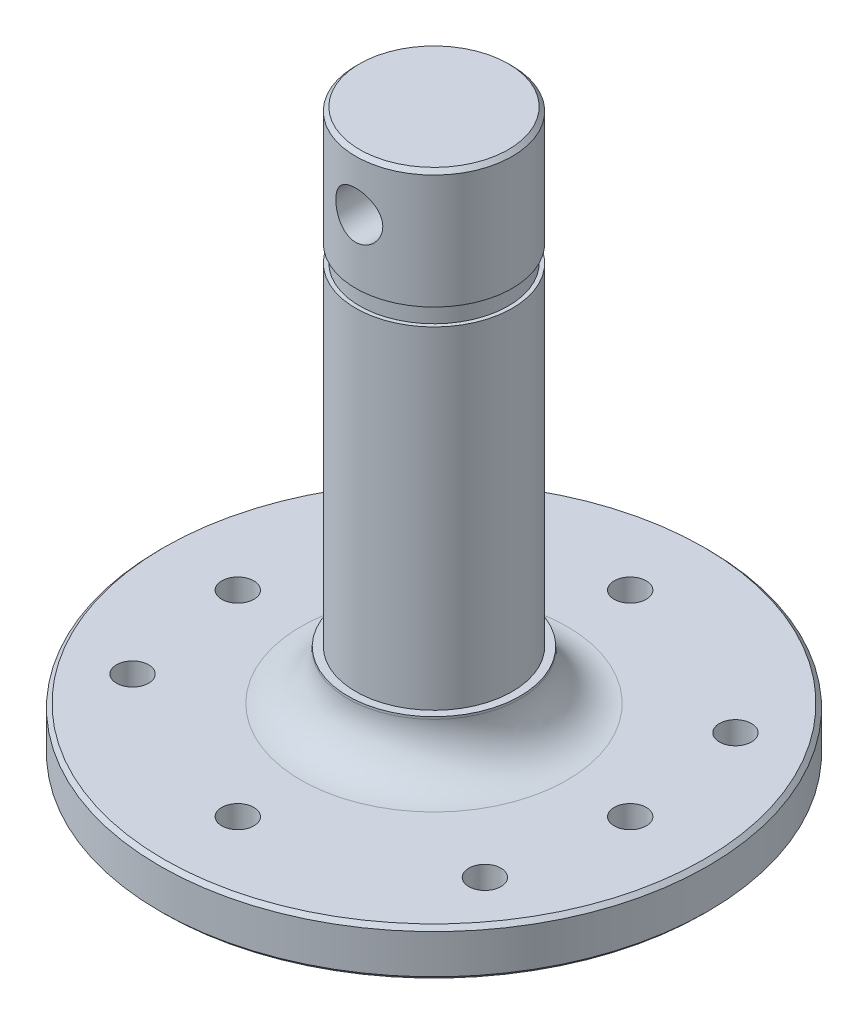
ISO-10303-21;
HEADER;
FILE_DESCRIPTION(('STEP AP214'),'2;1');
FILE_NAME('part.step','',(''),(''),'','','');
FILE_SCHEMA(('AUTOMOTIVE_DESIGN { 1 0 10303 214 1 1 1 1 }'));
ENDSEC;
DATA;
#1=APPLICATION_CONTEXT('core data for automotive mechanical design processes');
#2=APPLICATION_PROTOCOL_DEFINITION('international standard','automotive_design',2000,#1);
#3=PRODUCT_CONTEXT('',#1,'mechanical');
#4=PRODUCT('Part','Part','',(#3));
#5=PRODUCT_RELATED_PRODUCT_CATEGORY('part','',(#4));
#6=PRODUCT_DEFINITION_FORMATION('','',#4);
#7=PRODUCT_DEFINITION_CONTEXT('part definition',#1,'design');
#8=PRODUCT_DEFINITION('design','',#6,#7);
#9=PRODUCT_DEFINITION_SHAPE('','',#8);
#10=(LENGTH_UNIT() NAMED_UNIT(*) SI_UNIT(.MILLI.,.METRE.));
#11=(NAMED_UNIT(*) PLANE_ANGLE_UNIT() SI_UNIT($,.RADIAN.));
#12=(NAMED_UNIT(*) SI_UNIT($,.STERADIAN.) SOLID_ANGLE_UNIT());
#13=UNCERTAINTY_MEASURE_WITH_UNIT(LENGTH_MEASURE(1.E-05),#10,'distance_accuracy_value','');
#14=(GEOMETRIC_REPRESENTATION_CONTEXT(3) GLOBAL_UNCERTAINTY_ASSIGNED_CONTEXT((#13)) GLOBAL_UNIT_ASSIGNED_CONTEXT((#10,
#11,#12)) REPRESENTATION_CONTEXT('',''));
#15=CARTESIAN_POINT('',(0.,0.,0.));
#16=DIRECTION('',(0.,0.,1.));
#17=DIRECTION('',(1.,0.,0.));
#18=AXIS2_PLACEMENT_3D('',#15,#16,#17);
#19=CARTESIAN_POINT('',(-5.,36.,0.));
#20=DIRECTION('',(0.,-1.,0.));
#21=DIRECTION('',(0.,0.,-1.));
#22=AXIS2_PLACEMENT_3D('',#19,#20,#21);
#23=PLANE('',#22);
#24=CARTESIAN_POINT('',(0.,36.,0.));
#25=DIRECTION('',(0.,1.,0.));
#26=DIRECTION('',(0.,0.,-1.));
#27=AXIS2_PLACEMENT_3D('',#24,#25,#26);
#28=CIRCLE('',#27,4.75);
#29=CARTESIAN_POINT('',(0.,36.,-4.75));
#30=VERTEX_POINT('',#29);
#31=EDGE_CURVE('E42',#30,#30,#28,.T.);
#32=ORIENTED_EDGE('',*,*,#31,.T.);
#33=EDGE_LOOP('',(#32));
#34=FACE_BOUND('',#33,.T.);
#35=ADVANCED_FACE('F15',(#34),#23,.F.);
#36=CARTESIAN_POINT('',(-4.75,28.45,0.));
#37=DIRECTION('',(0.,1.,0.));
#38=DIRECTION('',(1.,0.,0.));
#39=AXIS2_PLACEMENT_3D('',#36,#37,#38);
#40=PLANE('',#39);
#41=CARTESIAN_POINT('',(0.,28.45,0.));
#42=DIRECTION('',(0.,-1.,0.));
#43=DIRECTION('',(0.,0.,-1.));
#44=AXIS2_PLACEMENT_3D('',#41,#42,#43);
#45=CIRCLE('',#44,4.75);
#46=CARTESIAN_POINT('',(0.,28.45,-4.75));
#47=VERTEX_POINT('',#46);
#48=EDGE_CURVE('E138',#47,#47,#45,.T.);
#49=ORIENTED_EDGE('',*,*,#48,.F.);
#50=EDGE_LOOP('',(#49));
#51=FACE_BOUND('',#50,.T.);
#52=CARTESIAN_POINT('',(0.,28.45,0.));
#53=DIRECTION('',(0.,-1.,0.));
#54=DIRECTION('',(0.,0.,-1.));
#55=AXIS2_PLACEMENT_3D('',#52,#53,#54);
#56=CIRCLE('',#55,5.);
#57=CARTESIAN_POINT('',(0.,28.45,-5.));
#58=VERTEX_POINT('',#57);
#59=EDGE_CURVE('E134',#58,#58,#56,.T.);
#60=ORIENTED_EDGE('',*,*,#59,.T.);
#61=EDGE_LOOP('',(#60));
#62=FACE_BOUND('',#61,.T.);
#63=ADVANCED_FACE('F204',(#51,#62),#40,.F.);
#64=CARTESIAN_POINT('',(-5.,27.35,0.));
#65=DIRECTION('',(0.,-1.,0.));
#66=DIRECTION('',(0.,0.,-1.));
#67=AXIS2_PLACEMENT_3D('',#64,#65,#66);
#68=PLANE('',#67);
#69=CARTESIAN_POINT('',(0.,27.35,0.));
#70=DIRECTION('',(0.,-1.,0.));
#71=DIRECTION('',(0.,0.,-1.));
#72=AXIS2_PLACEMENT_3D('',#69,#70,#71);
#73=CIRCLE('',#72,4.75);
#74=CARTESIAN_POINT('',(0.,27.35,-4.75));
#75=VERTEX_POINT('',#74);
#76=EDGE_CURVE('E142',#75,#75,#73,.T.);
#77=ORIENTED_EDGE('',*,*,#76,.T.);
#78=EDGE_LOOP('',(#77));
#79=FACE_BOUND('',#78,.T.);
#80=CARTESIAN_POINT('',(0.,27.35,0.));
#81=DIRECTION('',(0.,-1.,0.));
#82=DIRECTION('',(0.,0.,-1.));
#83=AXIS2_PLACEMENT_3D('',#80,#81,#82);
#84=CIRCLE('',#83,5.);
#85=CARTESIAN_POINT('',(0.,27.35,-5.));
#86=VERTEX_POINT('',#85);
#87=EDGE_CURVE('E38',#86,#86,#84,.T.);
#88=ORIENTED_EDGE('',*,*,#87,.F.);
#89=EDGE_LOOP('',(#88));
#90=FACE_BOUND('',#89,.T.);
#91=ADVANCED_FACE('F209',(#79,#90),#68,.F.);
#92=CARTESIAN_POINT('',(-5.5,6.15,0.));
#93=DIRECTION('',(0.,-1.,0.));
#94=DIRECTION('',(0.,0.,-1.));
#95=AXIS2_PLACEMENT_3D('',#92,#93,#94);
#96=PLANE('',#95);
#97=CARTESIAN_POINT('',(0.,6.15,0.));
#98=DIRECTION('',(0.,-1.,0.));
#99=DIRECTION('',(0.,0.,-1.));
#100=AXIS2_PLACEMENT_3D('',#97,#98,#99);
#101=CIRCLE('',#100,5.);
#102=CARTESIAN_POINT('',(0.,6.15,-5.));
#103=VERTEX_POINT('',#102);
#104=EDGE_CURVE('E28',#103,#103,#101,.T.);
#105=ORIENTED_EDGE('',*,*,#104,.T.);
#106=EDGE_LOOP('',(#105));
#107=FACE_BOUND('',#106,.T.);
#108=CARTESIAN_POINT('',(0.,6.15,0.));
#109=DIRECTION('',(0.,-1.,0.));
#110=DIRECTION('',(0.,0.,-1.));
#111=AXIS2_PLACEMENT_3D('',#108,#109,#110);
#112=CIRCLE('',#111,5.5);
#113=CARTESIAN_POINT('',(0.,6.15,-5.5));
#114=VERTEX_POINT('',#113);
#115=EDGE_CURVE('E10',#114,#114,#112,.T.);
#116=ORIENTED_EDGE('',*,*,#115,.F.);
#117=EDGE_LOOP('',(#116));
#118=FACE_BOUND('',#117,.T.);
#119=ADVANCED_FACE('F432',(#107,#118),#96,.F.);
#120=CARTESIAN_POINT('',(-17.5,3.,0.));
#121=DIRECTION('',(0.,-1.,0.));
#122=DIRECTION('',(0.,0.,-1.));
#123=AXIS2_PLACEMENT_3D('',#120,#121,#122);
#124=PLANE('',#123);
#125=CARTESIAN_POINT('',(-11.25,3.,8.));
#126=DIRECTION('',(0.,1.,0.));
#127=DIRECTION('',(0.,0.,1.));
#128=AXIS2_PLACEMENT_3D('',#125,#126,#127);
#129=CIRCLE('',#128,1.02499999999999);
#130=CARTESIAN_POINT('',(-11.25,3.,9.02499999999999));
#131=VERTEX_POINT('',#130);
#132=EDGE_CURVE('E130',#131,#131,#129,.T.);
#133=ORIENTED_EDGE('',*,*,#132,.F.);
#134=EDGE_LOOP('',(#133));
#135=FACE_BOUND('',#134,.T.);
#136=CARTESIAN_POINT('',(11.25,3.,8.));
#137=DIRECTION('',(0.,1.,0.));
#138=DIRECTION('',(0.,0.,1.));
#139=AXIS2_PLACEMENT_3D('',#136,#137,#138);
#140=CIRCLE('',#139,1.02499999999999);
#141=CARTESIAN_POINT('',(11.25,3.,9.02499999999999));
#142=VERTEX_POINT('',#141);
#143=EDGE_CURVE('E54',#142,#142,#140,.T.);
#144=ORIENTED_EDGE('',*,*,#143,.F.);
#145=EDGE_LOOP('',(#144));
#146=FACE_BOUND('',#145,.T.);
#147=CARTESIAN_POINT('',(11.25,3.,-8.));
#148=DIRECTION('',(0.,1.,0.));
#149=DIRECTION('',(0.,0.,1.));
#150=AXIS2_PLACEMENT_3D('',#147,#148,#149);
#151=CIRCLE('',#150,1.02499999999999);
#152=CARTESIAN_POINT('',(11.25,3.,-6.97500000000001));
#153=VERTEX_POINT('',#152);
#154=EDGE_CURVE('E55',#153,#153,#151,.T.);
#155=ORIENTED_EDGE('',*,*,#154,.F.);
#156=EDGE_LOOP('',(#155));
#157=FACE_BOUND('',#156,.T.);
#158=CARTESIAN_POINT('',(-11.25,3.,-8.));
#159=DIRECTION('',(0.,1.,0.));
#160=DIRECTION('',(0.,0.,1.));
#161=AXIS2_PLACEMENT_3D('',#158,#159,#160);
#162=CIRCLE('',#161,1.02499999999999);
#163=CARTESIAN_POINT('',(-11.25,3.,-6.97500000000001));
#164=VERTEX_POINT('',#163);
#165=EDGE_CURVE('E75',#164,#164,#162,.T.);
#166=ORIENTED_EDGE('',*,*,#165,.F.);
#167=EDGE_LOOP('',(#166));
#168=FACE_BOUND('',#167,.T.);
#169=CARTESIAN_POINT('',(0.,3.,0.));
#170=DIRECTION('',(0.,-1.,0.));
#171=DIRECTION('',(0.,0.,-1.));
#172=AXIS2_PLACEMENT_3D('',#169,#170,#171);
#173=CIRCLE('',#172,8.5);
#174=CARTESIAN_POINT('',(0.,3.,-8.5));
#175=VERTEX_POINT('',#174);
#176=EDGE_CURVE('E108',#175,#175,#173,.T.);
#177=ORIENTED_EDGE('',*,*,#176,.T.);
#178=EDGE_LOOP('',(#177));
#179=FACE_BOUND('',#178,.T.);
#180=CARTESIAN_POINT('',(0.,3.,12.5299640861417));
#181=DIRECTION('',(0.,-1.,0.));
#182=DIRECTION('',(0.,0.,-1.));
#183=AXIS2_PLACEMENT_3D('',#180,#181,#182);
#184=CIRCLE('',#183,1.025);
#185=CARTESIAN_POINT('',(0.,3.,11.5049640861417));
#186=VERTEX_POINT('',#185);
#187=EDGE_CURVE('E97',#186,#186,#184,.T.);
#188=ORIENTED_EDGE('',*,*,#187,.T.);
#189=EDGE_LOOP('',(#188));
#190=FACE_BOUND('',#189,.T.);
#191=CARTESIAN_POINT('',(12.5299640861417,3.,0.));
#192=DIRECTION('',(0.,-1.,0.));
#193=DIRECTION('',(0.,0.,-1.));
#194=AXIS2_PLACEMENT_3D('',#191,#192,#193);
#195=CIRCLE('',#194,1.025);
#196=CARTESIAN_POINT('',(12.5299640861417,3.,-1.025));
#197=VERTEX_POINT('',#196);
#198=EDGE_CURVE('E92',#197,#197,#195,.T.);
#199=ORIENTED_EDGE('',*,*,#198,.T.);
#200=EDGE_LOOP('',(#199));
#201=FACE_BOUND('',#200,.T.);
#202=CARTESIAN_POINT('',(0.,3.,-12.5299640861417));
#203=DIRECTION('',(0.,-1.,0.));
#204=DIRECTION('',(0.,0.,-1.));
#205=AXIS2_PLACEMENT_3D('',#202,#203,#204);
#206=CIRCLE('',#205,1.025);
#207=CARTESIAN_POINT('',(0.,3.,-13.5549640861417));
#208=VERTEX_POINT('',#207);
#209=EDGE_CURVE('E84',#208,#208,#206,.T.);
#210=ORIENTED_EDGE('',*,*,#209,.T.);
#211=EDGE_LOOP('',(#210));
#212=FACE_BOUND('',#211,.T.);
#213=CARTESIAN_POINT('',(-12.5299640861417,3.,0.));
#214=DIRECTION('',(0.,-1.,0.));
#215=DIRECTION('',(0.,0.,-1.));
#216=AXIS2_PLACEMENT_3D('',#213,#214,#215);
#217=CIRCLE('',#216,1.025);
#218=CARTESIAN_POINT('',(-12.5299640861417,3.,-1.02499999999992));
#219=VERTEX_POINT('',#218);
#220=EDGE_CURVE('E44',#219,#219,#217,.T.);
#221=ORIENTED_EDGE('',*,*,#220,.T.);
#222=EDGE_LOOP('',(#221));
#223=FACE_BOUND('',#222,.T.);
#224=CARTESIAN_POINT('',(0.,3.,0.));
#225=DIRECTION('',(0.,1.,0.));
#226=DIRECTION('',(0.,0.,-1.));
#227=AXIS2_PLACEMENT_3D('',#224,#225,#226);
#228=CIRCLE('',#227,17.25);
#229=CARTESIAN_POINT('',(0.,3.,-17.25));
#230=VERTEX_POINT('',#229);
#231=EDGE_CURVE('E68',#230,#230,#228,.T.);
#232=ORIENTED_EDGE('',*,*,#231,.T.);
#233=EDGE_LOOP('',(#232));
#234=FACE_BOUND('',#233,.T.);
#235=ADVANCED_FACE('F165',(#135,#146,#157,#168,#179,#190,#201,#212,#223,#234),#124,.F.);
#236=CARTESIAN_POINT('',(0.,0.,0.));
#237=DIRECTION('',(0.,1.,0.));
#238=DIRECTION('',(1.,0.,0.));
#239=AXIS2_PLACEMENT_3D('',#236,#237,#238);
#240=PLANE('',#239);
#241=CARTESIAN_POINT('',(-12.5299640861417,0.,0.));
#242=DIRECTION('',(0.,-1.,0.));
#243=DIRECTION('',(0.,0.,-1.));
#244=AXIS2_PLACEMENT_3D('',#241,#242,#243);
#245=CIRCLE('',#244,1.025);
#246=CARTESIAN_POINT('',(-12.5299640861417,0.,-1.02499999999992));
#247=VERTEX_POINT('',#246);
#248=EDGE_CURVE('E48',#247,#247,#245,.T.);
#249=ORIENTED_EDGE('',*,*,#248,.F.);
#250=EDGE_LOOP('',(#249));
#251=FACE_BOUND('',#250,.T.);
#252=CARTESIAN_POINT('',(12.5299640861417,0.,0.));
#253=DIRECTION('',(0.,-1.,0.));
#254=DIRECTION('',(0.,0.,-1.));
#255=AXIS2_PLACEMENT_3D('',#252,#253,#254);
#256=CIRCLE('',#255,1.025);
#257=CARTESIAN_POINT('',(12.5299640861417,0.,-1.025));
#258=VERTEX_POINT('',#257);
#259=EDGE_CURVE('E93',#258,#258,#256,.T.);
#260=ORIENTED_EDGE('',*,*,#259,.F.);
#261=EDGE_LOOP('',(#260));
#262=FACE_BOUND('',#261,.T.);
#263=CARTESIAN_POINT('',(0.,0.,12.5299640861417));
#264=DIRECTION('',(0.,-1.,0.));
#265=DIRECTION('',(0.,0.,-1.));
#266=AXIS2_PLACEMENT_3D('',#263,#264,#265);
#267=CIRCLE('',#266,1.025);
#268=CARTESIAN_POINT('',(0.,0.,11.5049640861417));
#269=VERTEX_POINT('',#268);
#270=EDGE_CURVE('E104',#269,#269,#267,.T.);
#271=ORIENTED_EDGE('',*,*,#270,.F.);
#272=EDGE_LOOP('',(#271));
#273=FACE_BOUND('',#272,.T.);
#274=CARTESIAN_POINT('',(-11.25,0.,8.));
#275=DIRECTION('',(0.,1.,0.));
#276=DIRECTION('',(0.,0.,1.));
#277=AXIS2_PLACEMENT_3D('',#274,#275,#276);
#278=CIRCLE('',#277,1.025);
#279=CARTESIAN_POINT('',(-11.25,0.,9.025));
#280=VERTEX_POINT('',#279);
#281=EDGE_CURVE('E126',#280,#280,#278,.T.);
#282=ORIENTED_EDGE('',*,*,#281,.T.);
#283=EDGE_LOOP('',(#282));
#284=FACE_BOUND('',#283,.T.);
#285=CARTESIAN_POINT('',(11.25,0.,8.));
#286=DIRECTION('',(0.,1.,0.));
#287=DIRECTION('',(0.,0.,1.));
#288=AXIS2_PLACEMENT_3D('',#285,#286,#287);
#289=CIRCLE('',#288,1.025);
#290=CARTESIAN_POINT('',(11.25,0.,9.025));
#291=VERTEX_POINT('',#290);
#292=EDGE_CURVE('E50',#291,#291,#289,.T.);
#293=ORIENTED_EDGE('',*,*,#292,.T.);
#294=EDGE_LOOP('',(#293));
#295=FACE_BOUND('',#294,.T.);
#296=CARTESIAN_POINT('',(11.25,0.,-8.));
#297=DIRECTION('',(0.,1.,0.));
#298=DIRECTION('',(0.,0.,1.));
#299=AXIS2_PLACEMENT_3D('',#296,#297,#298);
#300=CIRCLE('',#299,1.025);
#301=CARTESIAN_POINT('',(11.25,0.,-6.975));
#302=VERTEX_POINT('',#301);
#303=EDGE_CURVE('E79',#302,#302,#300,.T.);
#304=ORIENTED_EDGE('',*,*,#303,.T.);
#305=EDGE_LOOP('',(#304));
#306=FACE_BOUND('',#305,.T.);
#307=CARTESIAN_POINT('',(-11.25,0.,-8.));
#308=DIRECTION('',(0.,1.,0.));
#309=DIRECTION('',(0.,0.,1.));
#310=AXIS2_PLACEMENT_3D('',#307,#308,#309);
#311=CIRCLE('',#310,1.025);
#312=CARTESIAN_POINT('',(-11.25,0.,-6.975));
#313=VERTEX_POINT('',#312);
#314=EDGE_CURVE('E80',#313,#313,#311,.T.);
#315=ORIENTED_EDGE('',*,*,#314,.T.);
#316=EDGE_LOOP('',(#315));
#317=FACE_BOUND('',#316,.T.);
#318=CARTESIAN_POINT('',(0.,0.,-12.5299640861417));
#319=DIRECTION('',(0.,-1.,0.));
#320=DIRECTION('',(0.,0.,-1.));
#321=AXIS2_PLACEMENT_3D('',#318,#319,#320);
#322=CIRCLE('',#321,1.025);
#323=CARTESIAN_POINT('',(0.,0.,-13.5549640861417));
#324=VERTEX_POINT('',#323);
#325=EDGE_CURVE('E88',#324,#324,#322,.T.);
#326=ORIENTED_EDGE('',*,*,#325,.F.);
#327=EDGE_LOOP('',(#326));
#328=FACE_BOUND('',#327,.T.);
#329=CARTESIAN_POINT('',(0.,0.,0.));
#330=DIRECTION('',(0.,-1.,0.));
#331=DIRECTION('',(0.,0.,1.));
#332=AXIS2_PLACEMENT_3D('',#329,#330,#331);
#333=CIRCLE('',#332,17.25);
#334=CARTESIAN_POINT('',(0.,0.,17.25));
#335=VERTEX_POINT('',#334);
#336=EDGE_CURVE('E60',#335,#335,#333,.T.);
#337=ORIENTED_EDGE('',*,*,#336,.T.);
#338=EDGE_LOOP('',(#337));
#339=FACE_BOUND('',#338,.T.);
#340=ADVANCED_FACE('F405',(#251,#262,#273,#284,#295,#306,#317,#328,#339),#240,.F.);
#341=CARTESIAN_POINT('',(0.,0.,0.));
#342=DIRECTION('',(0.,-1.,0.));
#343=DIRECTION('',(0.,0.,-1.));
#344=AXIS2_PLACEMENT_3D('',#341,#342,#343);
#345=CYLINDRICAL_SURFACE('',#344,17.5);
#346=CARTESIAN_POINT('',(0.,0.249999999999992,0.));
#347=DIRECTION('',(0.,1.,0.));
#348=DIRECTION('',(0.,0.,1.));
#349=AXIS2_PLACEMENT_3D('',#346,#347,#348);
#350=CIRCLE('',#349,17.5);
#351=CARTESIAN_POINT('',(0.,0.249999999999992,17.5));
#352=VERTEX_POINT('',#351);
#353=EDGE_CURVE('E64',#352,#352,#350,.T.);
#354=ORIENTED_EDGE('',*,*,#353,.T.);
#355=EDGE_LOOP('',(#354));
#356=FACE_BOUND('',#355,.T.);
#357=CARTESIAN_POINT('',(0.,2.75,0.));
#358=DIRECTION('',(0.,-1.,0.));
#359=DIRECTION('',(0.,0.,-1.));
#360=AXIS2_PLACEMENT_3D('',#357,#358,#359);
#361=CIRCLE('',#360,17.5);
#362=CARTESIAN_POINT('',(0.,2.75,-17.5));
#363=VERTEX_POINT('',#362);
#364=EDGE_CURVE('E49',#363,#363,#361,.T.);
#365=ORIENTED_EDGE('',*,*,#364,.T.);
#366=EDGE_LOOP('',(#365));
#367=FACE_BOUND('',#366,.T.);
#368=ADVANCED_FACE('F410',(#356,#367),#345,.T.);
#369=CARTESIAN_POINT('',(0.,0.,0.));
#370=DIRECTION('',(0.,-1.,0.));
#371=DIRECTION('',(0.,0.,-1.));
#372=AXIS2_PLACEMENT_3D('',#369,#370,#371);
#373=CYLINDRICAL_SURFACE('',#372,5.5);
#374=CARTESIAN_POINT('',(0.,6.,0.));
#375=DIRECTION('',(0.,1.,0.));
#376=DIRECTION('',(0.,0.,-1.));
#377=AXIS2_PLACEMENT_3D('',#374,#375,#376);
#378=CIRCLE('',#377,5.5);
#379=CARTESIAN_POINT('',(0.,6.,-5.5));
#380=VERTEX_POINT('',#379);
#381=EDGE_CURVE('E112',#380,#380,#378,.T.);
#382=ORIENTED_EDGE('',*,*,#381,.T.);
#383=EDGE_LOOP('',(#382));
#384=FACE_BOUND('',#383,.T.);
#385=ORIENTED_EDGE('',*,*,#115,.T.);
#386=EDGE_LOOP('',(#385));
#387=FACE_BOUND('',#386,.T.);
#388=ADVANCED_FACE('F386',(#384,#387),#373,.T.);
#389=CARTESIAN_POINT('',(0.,0.,0.));
#390=DIRECTION('',(0.,-1.,0.));
#391=DIRECTION('',(0.,0.,-1.));
#392=AXIS2_PLACEMENT_3D('',#389,#390,#391);
#393=CYLINDRICAL_SURFACE('',#392,5.);
#394=ORIENTED_EDGE('',*,*,#104,.F.);
#395=EDGE_LOOP('',(#394));
#396=FACE_BOUND('',#395,.T.);
#397=ORIENTED_EDGE('',*,*,#87,.T.);
#398=EDGE_LOOP('',(#397));
#399=FACE_BOUND('',#398,.T.);
#400=ADVANCED_FACE('F189',(#396,#399),#393,.T.);
#401=CARTESIAN_POINT('',(0.,0.,0.));
#402=DIRECTION('',(0.,-1.,0.));
#403=DIRECTION('',(0.,0.,-1.));
#404=AXIS2_PLACEMENT_3D('',#401,#402,#403);
#405=CYLINDRICAL_SURFACE('',#404,4.75);
#406=ORIENTED_EDGE('',*,*,#76,.F.);
#407=EDGE_LOOP('',(#406));
#408=FACE_BOUND('',#407,.T.);
#409=ORIENTED_EDGE('',*,*,#48,.T.);
#410=EDGE_LOOP('',(#409));
#411=FACE_BOUND('',#410,.T.);
#412=ADVANCED_FACE('F163',(#408,#411),#405,.T.);
#413=CARTESIAN_POINT('',(0.,0.,0.));
#414=DIRECTION('',(0.,-1.,0.));
#415=DIRECTION('',(0.,0.,-1.));
#416=AXIS2_PLACEMENT_3D('',#413,#414,#415);
#417=CYLINDRICAL_SURFACE('',#416,5.);
#418=CARTESIAN_POINT('',(-3.90195861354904E-13,31.,5.));
#419=CARTESIAN_POINT('',(-0.082243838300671,31.0000035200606,4.99999761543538));
#420=CARTESIAN_POINT('',(-0.164531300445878,31.0067903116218,4.9979499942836));
#421=CARTESIAN_POINT('',(-0.326743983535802,31.0337082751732,4.98997514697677));
#422=CARTESIAN_POINT('',(-0.406666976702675,31.0538516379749,4.98404437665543));
#423=CARTESIAN_POINT('',(-0.561736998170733,31.1067481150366,4.9689548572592));
#424=CARTESIAN_POINT('',(-0.636891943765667,31.1394796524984,4.95980163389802));
#425=CARTESIAN_POINT('',(-0.780634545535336,31.2165425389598,4.93921946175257));
#426=CARTESIAN_POINT('',(-0.849222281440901,31.2608737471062,4.92779054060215));
#427=CARTESIAN_POINT('',(-0.979865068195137,31.3612187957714,4.90350858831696));
#428=CARTESIAN_POINT('',(-1.04170562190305,31.4175048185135,4.89062639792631));
#429=CARTESIAN_POINT('',(-1.15523895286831,31.5395966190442,4.86506089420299));
#430=CARTESIAN_POINT('',(-1.20692799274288,31.6054058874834,4.8523776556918));
#431=CARTESIAN_POINT('',(-1.2998229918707,31.7465033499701,4.82833517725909));
#432=CARTESIAN_POINT('',(-1.34076207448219,31.8219739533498,4.81701286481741));
#433=CARTESIAN_POINT('',(-1.40924181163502,31.979077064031,4.79742828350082));
#434=CARTESIAN_POINT('',(-1.43679864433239,32.0607019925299,4.78916232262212));
#435=CARTESIAN_POINT('',(-1.47137182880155,32.2022626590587,4.77862706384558));
#436=CARTESIAN_POINT('',(-1.48208663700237,32.2612422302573,4.77529847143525));
#437=CARTESIAN_POINT('',(-1.49640180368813,32.3801401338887,4.770831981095));
#438=CARTESIAN_POINT('',(-1.50000262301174,32.4400584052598,4.76969394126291));
#439=CARTESIAN_POINT('',(-1.49999640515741,32.5821500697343,4.76969883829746));
#440=CARTESIAN_POINT('',(-1.4932245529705,32.6643439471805,4.77184310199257));
#441=CARTESIAN_POINT('',(-1.46637133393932,32.8263618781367,4.78016151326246));
#442=CARTESIAN_POINT('',(-1.44627744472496,32.9061836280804,4.78633945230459));
#443=CARTESIAN_POINT('',(-1.39352546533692,33.0610389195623,4.80196172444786));
#444=CARTESIAN_POINT('',(-1.36089119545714,33.1360812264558,4.8113998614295));
#445=CARTESIAN_POINT('',(-1.28405789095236,33.2796321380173,4.83247095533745));
#446=CARTESIAN_POINT('',(-1.23985877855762,33.3481406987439,4.84410392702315));
#447=CARTESIAN_POINT('',(-1.1396527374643,33.478859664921,4.86866739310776));
#448=CARTESIAN_POINT('',(-1.08334384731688,33.5408334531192,4.88162550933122));
#449=CARTESIAN_POINT('',(-0.961148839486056,33.6546276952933,4.90714610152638));
#450=CARTESIAN_POINT('',(-0.895259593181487,33.7064448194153,4.91970844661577));
#451=CARTESIAN_POINT('',(-0.754079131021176,33.7994851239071,4.94333792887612));
#452=CARTESIAN_POINT('',(-0.678619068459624,33.8404620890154,4.95436798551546));
#453=CARTESIAN_POINT('',(-0.521537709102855,33.9090149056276,4.97335198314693));
#454=CARTESIAN_POINT('',(-0.439923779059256,33.9366064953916,4.98130953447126));
#455=CARTESIAN_POINT('',(-0.298273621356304,33.971268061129,4.99143793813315));
#456=CARTESIAN_POINT('',(-0.239185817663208,33.9820220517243,4.99463136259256));
#457=CARTESIAN_POINT('',(-0.12007306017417,33.9963891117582,4.99891320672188));
#458=CARTESIAN_POINT('',(-0.060048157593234,34.0000025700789,5.00000174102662));
#459=CARTESIAN_POINT('',(0.0822438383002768,33.9999964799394,4.99999761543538));
#460=CARTESIAN_POINT('',(0.164531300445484,33.9932096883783,4.99794999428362));
#461=CARTESIAN_POINT('',(0.326743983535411,33.9662917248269,4.9899751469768));
#462=CARTESIAN_POINT('',(0.406666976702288,33.9461483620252,4.98404437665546));
#463=CARTESIAN_POINT('',(0.561736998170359,33.8932518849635,4.96895485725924));
#464=CARTESIAN_POINT('',(0.636891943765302,33.8605203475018,4.95980163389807));
#465=CARTESIAN_POINT('',(0.780634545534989,33.7834574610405,4.93921946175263));
#466=CARTESIAN_POINT('',(0.849222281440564,33.739126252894,4.92779054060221));
#467=CARTESIAN_POINT('',(0.979865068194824,33.6387812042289,4.90350858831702));
#468=CARTESIAN_POINT('',(1.04170562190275,33.5824951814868,4.89062639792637));
#469=CARTESIAN_POINT('',(1.15523895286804,33.4604033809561,4.86506089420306));
#470=CARTESIAN_POINT('',(1.20692799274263,33.3945941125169,4.85237765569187));
#471=CARTESIAN_POINT('',(1.29982299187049,33.2534966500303,4.82833517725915));
#472=CARTESIAN_POINT('',(1.340762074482,33.1780260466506,4.81701286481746));
#473=CARTESIAN_POINT('',(1.40924181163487,33.0209229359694,4.79742828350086));
#474=CARTESIAN_POINT('',(1.43679864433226,32.9392980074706,4.78916232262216));
#475=CARTESIAN_POINT('',(1.47137182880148,32.7977373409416,4.7786270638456));
#476=CARTESIAN_POINT('',(1.48208663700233,32.738757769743,4.77529847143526));
#477=CARTESIAN_POINT('',(1.49640180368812,32.6198598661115,4.77083198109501));
#478=CARTESIAN_POINT('',(1.50000262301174,32.5599415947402,4.76969394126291));
#479=CARTESIAN_POINT('',(1.49999640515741,32.4178499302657,4.76969883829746));
#480=CARTESIAN_POINT('',(1.4932245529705,32.3356560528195,4.77184310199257));
#481=CARTESIAN_POINT('',(1.46637133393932,32.1736381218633,4.78016151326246));
#482=CARTESIAN_POINT('',(1.44627744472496,32.0938163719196,4.78633945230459));
#483=CARTESIAN_POINT('',(1.39352546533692,31.9389610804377,4.80196172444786));
#484=CARTESIAN_POINT('',(1.36089119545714,31.8639187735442,4.8113998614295));
#485=CARTESIAN_POINT('',(1.28405789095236,31.7203678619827,4.83247095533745));
#486=CARTESIAN_POINT('',(1.23985877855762,31.6518593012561,4.84410392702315));
#487=CARTESIAN_POINT('',(1.1396527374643,31.521140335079,4.86866739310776));
#488=CARTESIAN_POINT('',(1.08334384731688,31.4591665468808,4.88162550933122));
#489=CARTESIAN_POINT('',(0.961148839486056,31.3453723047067,4.90714610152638));
#490=CARTESIAN_POINT('',(0.895259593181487,31.2935551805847,4.91970844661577));
#491=CARTESIAN_POINT('',(0.754079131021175,31.2005148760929,4.94333792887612));
#492=CARTESIAN_POINT('',(0.678619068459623,31.1595379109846,4.95436798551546));
#493=CARTESIAN_POINT('',(0.521537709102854,31.0909850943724,4.97335198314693));
#494=CARTESIAN_POINT('',(0.439923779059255,31.0633935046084,4.98130953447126));
#495=CARTESIAN_POINT('',(0.298273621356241,31.028731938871,4.99143793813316));
#496=CARTESIAN_POINT('',(0.23918581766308,31.0179779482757,4.99463136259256));
#497=CARTESIAN_POINT('',(0.12007306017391,31.0036108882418,4.99891320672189));
#498=CARTESIAN_POINT('',(0.060048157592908,30.9999974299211,5.00000174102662));
#499=CARTESIAN_POINT('',(-3.90195861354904E-13,31.,5.));
#500=B_SPLINE_CURVE_WITH_KNOTS('',3,(#418,#419,#420,#421,#422,#423,#424,#425,#426,#427,#428,
#429,#430,#431,#432,#433,#434,#435,#436,#437,#438,#439,#440,#441,#442,#443,#444,#445,#446,#447,
#448,#449,#450,#451,#452,#453,#454,#455,#456,#457,#458,#459,#460,#461,#462,#463,#464,#465,#466,
#467,#468,#469,#470,#471,#472,#473,#474,#475,#476,#477,#478,#479,#480,#481,#482,#483,#484,#485,
#486,#487,#488,#489,#490,#491,#492,#493,#494,#495,#496,#497,#498,#499),.UNSPECIFIED.,.T.,.F.,(4,
2,2,2,2,2,2,2,2,2,2,2,2,2,2,2,2,2,2,2,2,2,2,2,2,2,2,2,2,2,2,2,2,2,2,2,2,2,2,2,4),(0.,
0.246507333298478,0.493239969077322,0.739551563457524,0.985860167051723,1.23853084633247,
1.49129437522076,1.74984044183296,2.00807316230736,2.18774557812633,2.36740635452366,
2.61363179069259,2.86008900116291,3.10608036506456,3.35207338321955,3.60511269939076,
3.85823483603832,4.11669019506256,4.37484092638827,4.55483152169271,4.73481231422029,
4.98131964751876,5.2280522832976,5.4743638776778,5.72067248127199,5.97334316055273,
6.22610668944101,6.48465275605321,6.74288547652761,6.92255789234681,7.10221866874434,
7.34844410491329,7.59490131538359,7.84089267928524,8.08688569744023,8.33992501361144,
8.593047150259,8.85150250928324,9.10965324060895,9.28964383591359,9.46962462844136),.UNSPECIFIED.);
#501=CARTESIAN_POINT('',(-3.90195861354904E-13,31.,5.));
#502=VERTEX_POINT('',#501);
#503=EDGE_CURVE('E119',#502,#502,#500,.T.);
#504=ORIENTED_EDGE('',*,*,#503,.T.);
#505=EDGE_LOOP('',(#504));
#506=FACE_BOUND('',#505,.T.);
#507=ORIENTED_EDGE('',*,*,#59,.F.);
#508=EDGE_LOOP('',(#507));
#509=FACE_BOUND('',#508,.T.);
#510=CARTESIAN_POINT('',(0.,35.75,0.));
#511=DIRECTION('',(0.,-1.,0.));
#512=DIRECTION('',(0.,0.,-1.));
#513=AXIS2_PLACEMENT_3D('',#510,#511,#512);
#514=CIRCLE('',#513,5.);
#515=CARTESIAN_POINT('',(0.,35.75,-5.));
#516=VERTEX_POINT('',#515);
#517=EDGE_CURVE('E56',#516,#516,#514,.T.);
#518=ORIENTED_EDGE('',*,*,#517,.T.);
#519=EDGE_LOOP('',(#518));
#520=FACE_BOUND('',#519,.T.);
#521=CARTESIAN_POINT('',(-1.5,32.5,-4.76969600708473));
#522=CARTESIAN_POINT('',(-1.49999640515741,32.4178499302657,-4.76969883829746));
#523=CARTESIAN_POINT('',(-1.4932245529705,32.3356560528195,-4.77184310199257));
#524=CARTESIAN_POINT('',(-1.46637133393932,32.1736381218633,-4.78016151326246));
#525=CARTESIAN_POINT('',(-1.44627744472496,32.0938163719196,-4.78633945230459));
#526=CARTESIAN_POINT('',(-1.39352546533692,31.9389610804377,-4.80196172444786));
#527=CARTESIAN_POINT('',(-1.36089119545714,31.8639187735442,-4.8113998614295));
#528=CARTESIAN_POINT('',(-1.28405789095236,31.7203678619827,-4.83247095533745));
#529=CARTESIAN_POINT('',(-1.23985877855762,31.6518593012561,-4.84410392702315));
#530=CARTESIAN_POINT('',(-1.1396527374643,31.521140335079,-4.86866739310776));
#531=CARTESIAN_POINT('',(-1.08334384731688,31.4591665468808,-4.88162550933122));
#532=CARTESIAN_POINT('',(-0.961148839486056,31.3453723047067,-4.90714610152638));
#533=CARTESIAN_POINT('',(-0.895259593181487,31.2935551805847,-4.91970844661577));
#534=CARTESIAN_POINT('',(-0.754079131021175,31.2005148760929,-4.94333792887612));
#535=CARTESIAN_POINT('',(-0.678619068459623,31.1595379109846,-4.95436798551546));
#536=CARTESIAN_POINT('',(-0.521537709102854,31.0909850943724,-4.97335198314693));
#537=CARTESIAN_POINT('',(-0.439923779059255,31.0633935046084,-4.98130953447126));
#538=CARTESIAN_POINT('',(-0.298273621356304,31.028731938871,-4.99143793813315));
#539=CARTESIAN_POINT('',(-0.239185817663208,31.0179779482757,-4.99463136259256));
#540=CARTESIAN_POINT('',(-0.120073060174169,31.0036108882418,-4.99891320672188));
#541=CARTESIAN_POINT('',(-0.0600481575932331,30.9999974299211,-5.00000174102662));
#542=CARTESIAN_POINT('',(0.0822438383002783,31.0000035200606,-4.99999761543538));
#543=CARTESIAN_POINT('',(0.164531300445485,31.0067903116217,-4.99794999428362));
#544=CARTESIAN_POINT('',(0.326743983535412,31.0337082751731,-4.9899751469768));
#545=CARTESIAN_POINT('',(0.406666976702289,31.0538516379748,-4.98404437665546));
#546=CARTESIAN_POINT('',(0.561736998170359,31.1067481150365,-4.96895485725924));
#547=CARTESIAN_POINT('',(0.636891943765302,31.1394796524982,-4.95980163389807));
#548=CARTESIAN_POINT('',(0.780634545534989,31.2165425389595,-4.93921946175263));
#549=CARTESIAN_POINT('',(0.849222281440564,31.260873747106,-4.92779054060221));
#550=CARTESIAN_POINT('',(0.979865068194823,31.3612187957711,-4.90350858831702));
#551=CARTESIAN_POINT('',(1.04170562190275,31.4175048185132,-4.89062639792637));
#552=CARTESIAN_POINT('',(1.15523895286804,31.5395966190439,-4.86506089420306));
#553=CARTESIAN_POINT('',(1.20692799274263,31.6054058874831,-4.85237765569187));
#554=CARTESIAN_POINT('',(1.29982299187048,31.7465033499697,-4.82833517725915));
#555=CARTESIAN_POINT('',(1.340762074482,31.8219739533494,-4.81701286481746));
#556=CARTESIAN_POINT('',(1.40924181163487,31.9790770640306,-4.79742828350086));
#557=CARTESIAN_POINT('',(1.43679864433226,32.0607019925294,-4.78916232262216));
#558=CARTESIAN_POINT('',(1.47137182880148,32.2022626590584,-4.7786270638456));
#559=CARTESIAN_POINT('',(1.48208663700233,32.261242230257,-4.77529847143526));
#560=CARTESIAN_POINT('',(1.49640180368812,32.3801401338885,-4.77083198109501));
#561=CARTESIAN_POINT('',(1.50000262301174,32.4400584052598,-4.76969394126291));
#562=CARTESIAN_POINT('',(1.49999640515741,32.5821500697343,-4.76969883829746));
#563=CARTESIAN_POINT('',(1.4932245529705,32.6643439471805,-4.77184310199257));
#564=CARTESIAN_POINT('',(1.46637133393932,32.8263618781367,-4.78016151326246));
#565=CARTESIAN_POINT('',(1.44627744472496,32.9061836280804,-4.78633945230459));
#566=CARTESIAN_POINT('',(1.39352546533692,33.0610389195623,-4.80196172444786));
#567=CARTESIAN_POINT('',(1.36089119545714,33.1360812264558,-4.8113998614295));
#568=CARTESIAN_POINT('',(1.28405789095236,33.2796321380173,-4.83247095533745));
#569=CARTESIAN_POINT('',(1.23985877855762,33.3481406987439,-4.84410392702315));
#570=CARTESIAN_POINT('',(1.1396527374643,33.478859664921,-4.86866739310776));
#571=CARTESIAN_POINT('',(1.08334384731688,33.5408334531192,-4.88162550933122));
#572=CARTESIAN_POINT('',(0.961148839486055,33.6546276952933,-4.90714610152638));
#573=CARTESIAN_POINT('',(0.895259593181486,33.7064448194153,-4.91970844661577));
#574=CARTESIAN_POINT('',(0.754079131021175,33.7994851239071,-4.94333792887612));
#575=CARTESIAN_POINT('',(0.678619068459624,33.8404620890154,-4.95436798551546));
#576=CARTESIAN_POINT('',(0.521537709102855,33.9090149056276,-4.97335198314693));
#577=CARTESIAN_POINT('',(0.439923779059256,33.9366064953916,-4.98130953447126));
#578=CARTESIAN_POINT('',(0.298273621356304,33.971268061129,-4.99143793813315));
#579=CARTESIAN_POINT('',(0.239185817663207,33.9820220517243,-4.99463136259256));
#580=CARTESIAN_POINT('',(0.120073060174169,33.9963891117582,-4.99891320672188));
#581=CARTESIAN_POINT('',(0.0600481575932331,34.0000025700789,-5.00000174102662));
#582=CARTESIAN_POINT('',(-0.082243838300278,33.9999964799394,-4.99999761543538));
#583=CARTESIAN_POINT('',(-0.164531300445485,33.9932096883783,-4.99794999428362));
#584=CARTESIAN_POINT('',(-0.326743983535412,33.9662917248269,-4.9899751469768));
#585=CARTESIAN_POINT('',(-0.40666697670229,33.9461483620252,-4.98404437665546));
#586=CARTESIAN_POINT('',(-0.56173699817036,33.8932518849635,-4.96895485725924));
#587=CARTESIAN_POINT('',(-0.636891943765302,33.8605203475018,-4.95980163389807));
#588=CARTESIAN_POINT('',(-0.780634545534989,33.7834574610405,-4.93921946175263));
#589=CARTESIAN_POINT('',(-0.849222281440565,33.739126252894,-4.92779054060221));
#590=CARTESIAN_POINT('',(-0.979865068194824,33.6387812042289,-4.90350858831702));
#591=CARTESIAN_POINT('',(-1.04170562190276,33.5824951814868,-4.89062639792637));
#592=CARTESIAN_POINT('',(-1.15523895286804,33.4604033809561,-4.86506089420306));
#593=CARTESIAN_POINT('',(-1.20692799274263,33.3945941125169,-4.85237765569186));
#594=CARTESIAN_POINT('',(-1.29982299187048,33.2534966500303,-4.82833517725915));
#595=CARTESIAN_POINT('',(-1.340762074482,33.1780260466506,-4.81701286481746));
#596=CARTESIAN_POINT('',(-1.40924181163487,33.0209229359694,-4.79742828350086));
#597=CARTESIAN_POINT('',(-1.43679864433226,32.9392980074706,-4.78916232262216));
#598=CARTESIAN_POINT('',(-1.47137182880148,32.7977373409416,-4.7786270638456));
#599=CARTESIAN_POINT('',(-1.48208663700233,32.738757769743,-4.77529847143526));
#600=CARTESIAN_POINT('',(-1.49640180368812,32.6198598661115,-4.77083198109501));
#601=CARTESIAN_POINT('',(-1.50000262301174,32.5599415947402,-4.76969394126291));
#602=CARTESIAN_POINT('',(-1.5,32.5,-4.76969600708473));
#603=B_SPLINE_CURVE_WITH_KNOTS('',3,(#521,#522,#523,#524,#525,#526,#527,#528,#529,#530,#531,
#532,#533,#534,#535,#536,#537,#538,#539,#540,#541,#542,#543,#544,#545,#546,#547,#548,#549,#550,
#551,#552,#553,#554,#555,#556,#557,#558,#559,#560,#561,#562,#563,#564,#565,#566,#567,#568,#569,
#570,#571,#572,#573,#574,#575,#576,#577,#578,#579,#580,#581,#582,#583,#584,#585,#586,#587,#588,
#589,#590,#591,#592,#593,#594,#595,#596,#597,#598,#599,#600,#601,#602),.UNSPECIFIED.,.T.,.F.,(4,
2,2,2,2,2,2,2,2,2,2,2,2,2,2,2,2,2,2,2,2,2,2,2,2,2,2,2,2,2,2,2,2,2,2,2,2,2,2,2,4),(0.,
0.246225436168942,0.492682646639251,0.738674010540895,0.984667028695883,1.2377063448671,
1.49082848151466,1.7492838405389,2.00743457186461,2.18742516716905,2.36740595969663,
2.6139132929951,2.86064592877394,3.10695752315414,3.35326612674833,3.60593680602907,
3.85870033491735,4.11724640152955,4.37547912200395,4.55515153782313,4.73481231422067,
4.98103775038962,5.22749496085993,5.47348632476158,5.71947934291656,5.97251865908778,
6.22564079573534,6.48409615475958,6.74224688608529,6.92223748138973,7.10221827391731,
7.34872560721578,7.59545824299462,7.84176983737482,8.08807844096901,8.34074912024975,
8.59351264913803,8.85205871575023,9.11029143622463,9.28996385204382,9.46962462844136),.UNSPECIFIED.);
#604=CARTESIAN_POINT('',(-1.5,32.5,-4.76969600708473));
#605=VERTEX_POINT('',#604);
#606=EDGE_CURVE('E18',#605,#605,#603,.T.);
#607=ORIENTED_EDGE('',*,*,#606,.T.);
#608=EDGE_LOOP('',(#607));
#609=FACE_BOUND('',#608,.T.);
#610=ADVANCED_FACE('F157',(#506,#509,#520,#609),#417,.T.);
#611=CARTESIAN_POINT('',(-11.25,3.,8.));
#612=DIRECTION('',(0.,1.,0.));
#613=DIRECTION('',(0.,0.,1.));
#614=AXIS2_PLACEMENT_3D('',#611,#612,#613);
#615=CYLINDRICAL_SURFACE('',#614,1.025);
#616=ORIENTED_EDGE('',*,*,#132,.T.);
#617=EDGE_LOOP('',(#616));
#618=FACE_BOUND('',#617,.T.);
#619=ORIENTED_EDGE('',*,*,#281,.F.);
#620=EDGE_LOOP('',(#619));
#621=FACE_BOUND('',#620,.T.);
#622=ADVANCED_FACE('F162',(#618,#621),#615,.F.);
#623=CARTESIAN_POINT('',(11.25,3.,8.));
#624=DIRECTION('',(0.,1.,0.));
#625=DIRECTION('',(0.,0.,1.));
#626=AXIS2_PLACEMENT_3D('',#623,#624,#625);
#627=CYLINDRICAL_SURFACE('',#626,1.025);
#628=ORIENTED_EDGE('',*,*,#143,.T.);
#629=EDGE_LOOP('',(#628));
#630=FACE_BOUND('',#629,.T.);
#631=ORIENTED_EDGE('',*,*,#292,.F.);
#632=EDGE_LOOP('',(#631));
#633=FACE_BOUND('',#632,.T.);
#634=ADVANCED_FACE('F361',(#630,#633),#627,.F.);
#635=CARTESIAN_POINT('',(11.25,3.,-8.));
#636=DIRECTION('',(0.,1.,0.));
#637=DIRECTION('',(0.,0.,1.));
#638=AXIS2_PLACEMENT_3D('',#635,#636,#637);
#639=CYLINDRICAL_SURFACE('',#638,1.025);
#640=ORIENTED_EDGE('',*,*,#154,.T.);
#641=EDGE_LOOP('',(#640));
#642=FACE_BOUND('',#641,.T.);
#643=ORIENTED_EDGE('',*,*,#303,.F.);
#644=EDGE_LOOP('',(#643));
#645=FACE_BOUND('',#644,.T.);
#646=ADVANCED_FACE('F181',(#642,#645),#639,.F.);
#647=CARTESIAN_POINT('',(-11.25,3.,-8.));
#648=DIRECTION('',(0.,1.,0.));
#649=DIRECTION('',(0.,0.,1.));
#650=AXIS2_PLACEMENT_3D('',#647,#648,#649);
#651=CYLINDRICAL_SURFACE('',#650,1.025);
#652=ORIENTED_EDGE('',*,*,#165,.T.);
#653=EDGE_LOOP('',(#652));
#654=FACE_BOUND('',#653,.T.);
#655=ORIENTED_EDGE('',*,*,#314,.F.);
#656=EDGE_LOOP('',(#655));
#657=FACE_BOUND('',#656,.T.);
#658=ADVANCED_FACE('F178',(#654,#657),#651,.F.);
#659=CARTESIAN_POINT('',(0.,32.5,-10.));
#660=DIRECTION('',(0.,0.,1.));
#661=DIRECTION('',(1.,0.,0.));
#662=AXIS2_PLACEMENT_3D('',#659,#660,#661);
#663=CYLINDRICAL_SURFACE('',#662,1.5);
#664=ORIENTED_EDGE('',*,*,#503,.F.);
#665=EDGE_LOOP('',(#664));
#666=FACE_BOUND('',#665,.T.);
#667=ORIENTED_EDGE('',*,*,#606,.F.);
#668=EDGE_LOOP('',(#667));
#669=FACE_BOUND('',#668,.T.);
#670=ADVANCED_FACE('F153',(#666,#669),#663,.F.);
#671=CARTESIAN_POINT('',(0.,6.,0.));
#672=DIRECTION('',(0.,-1.,0.));
#673=DIRECTION('',(0.,0.,-1.));
#674=AXIS2_PLACEMENT_3D('',#671,#672,#673);
#675=TOROIDAL_SURFACE('',#674,8.5,3.);
#676=ORIENTED_EDGE('',*,*,#381,.F.);
#677=EDGE_LOOP('',(#676));
#678=FACE_BOUND('',#677,.T.);
#679=ORIENTED_EDGE('',*,*,#176,.F.);
#680=EDGE_LOOP('',(#679));
#681=FACE_BOUND('',#680,.T.);
#682=ADVANCED_FACE('F192',(#678,#681),#675,.F.);
#683=CARTESIAN_POINT('',(0.,0.,12.5299640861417));
#684=DIRECTION('',(0.,-1.,0.));
#685=DIRECTION('',(0.,0.,-1.));
#686=AXIS2_PLACEMENT_3D('',#683,#684,#685);
#687=CYLINDRICAL_SURFACE('',#686,1.025);
#688=ORIENTED_EDGE('',*,*,#270,.T.);
#689=EDGE_LOOP('',(#688));
#690=FACE_BOUND('',#689,.T.);
#691=ORIENTED_EDGE('',*,*,#187,.F.);
#692=EDGE_LOOP('',(#691));
#693=FACE_BOUND('',#692,.T.);
#694=ADVANCED_FACE('F185',(#690,#693),#687,.F.);
#695=CARTESIAN_POINT('',(12.5299640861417,0.,0.));
#696=DIRECTION('',(0.,-1.,0.));
#697=DIRECTION('',(0.,0.,-1.));
#698=AXIS2_PLACEMENT_3D('',#695,#696,#697);
#699=CYLINDRICAL_SURFACE('',#698,1.025);
#700=ORIENTED_EDGE('',*,*,#259,.T.);
#701=EDGE_LOOP('',(#700));
#702=FACE_BOUND('',#701,.T.);
#703=ORIENTED_EDGE('',*,*,#198,.F.);
#704=EDGE_LOOP('',(#703));
#705=FACE_BOUND('',#704,.T.);
#706=ADVANCED_FACE('F176',(#702,#705),#699,.F.);
#707=CARTESIAN_POINT('',(0.,0.,-12.5299640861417));
#708=DIRECTION('',(0.,-1.,0.));
#709=DIRECTION('',(0.,0.,-1.));
#710=AXIS2_PLACEMENT_3D('',#707,#708,#709);
#711=CYLINDRICAL_SURFACE('',#710,1.025);
#712=ORIENTED_EDGE('',*,*,#325,.T.);
#713=EDGE_LOOP('',(#712));
#714=FACE_BOUND('',#713,.T.);
#715=ORIENTED_EDGE('',*,*,#209,.F.);
#716=EDGE_LOOP('',(#715));
#717=FACE_BOUND('',#716,.T.);
#718=ADVANCED_FACE('F172',(#714,#717),#711,.F.);
#719=CARTESIAN_POINT('',(-12.5299640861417,0.,0.));
#720=DIRECTION('',(0.,-1.,0.));
#721=DIRECTION('',(0.,0.,-1.));
#722=AXIS2_PLACEMENT_3D('',#719,#720,#721);
#723=CYLINDRICAL_SURFACE('',#722,1.025);
#724=ORIENTED_EDGE('',*,*,#248,.T.);
#725=EDGE_LOOP('',(#724));
#726=FACE_BOUND('',#725,.T.);
#727=ORIENTED_EDGE('',*,*,#220,.F.);
#728=EDGE_LOOP('',(#727));
#729=FACE_BOUND('',#728,.T.);
#730=ADVANCED_FACE('F167',(#726,#729),#723,.F.);
#731=CARTESIAN_POINT('',(0.,2.75,0.));
#732=DIRECTION('',(0.,-1.,0.));
#733=DIRECTION('',(0.,0.,-1.));
#734=AXIS2_PLACEMENT_3D('',#731,#732,#733);
#735=CONICAL_SURFACE('',#734,17.5,0.785398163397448);
#736=ORIENTED_EDGE('',*,*,#364,.F.);
#737=EDGE_LOOP('',(#736));
#738=FACE_BOUND('',#737,.T.);
#739=ORIENTED_EDGE('',*,*,#231,.F.);
#740=EDGE_LOOP('',(#739));
#741=FACE_BOUND('',#740,.T.);
#742=ADVANCED_FACE('F171',(#738,#741),#735,.T.);
#743=CARTESIAN_POINT('',(0.,0.,0.));
#744=DIRECTION('',(0.,1.,0.));
#745=DIRECTION('',(0.,0.,1.));
#746=AXIS2_PLACEMENT_3D('',#743,#744,#745);
#747=CONICAL_SURFACE('',#746,17.25,0.785398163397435);
#748=ORIENTED_EDGE('',*,*,#353,.F.);
#749=EDGE_LOOP('',(#748));
#750=FACE_BOUND('',#749,.T.);
#751=ORIENTED_EDGE('',*,*,#336,.F.);
#752=EDGE_LOOP('',(#751));
#753=FACE_BOUND('',#752,.T.);
#754=ADVANCED_FACE('F374',(#750,#753),#747,.T.);
#755=CARTESIAN_POINT('',(0.,35.75,0.));
#756=DIRECTION('',(0.,-1.,0.));
#757=DIRECTION('',(0.,0.,-1.));
#758=AXIS2_PLACEMENT_3D('',#755,#756,#757);
#759=CONICAL_SURFACE('',#758,5.,0.785398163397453);
#760=ORIENTED_EDGE('',*,*,#517,.F.);
#761=EDGE_LOOP('',(#760));
#762=FACE_BOUND('',#761,.T.);
#763=ORIENTED_EDGE('',*,*,#31,.F.);
#764=EDGE_LOOP('',(#763));
#765=FACE_BOUND('',#764,.T.);
#766=ADVANCED_FACE('F370',(#762,#765),#759,.T.);
#767=CLOSED_SHELL('',(#35,#63,#91,#119,#235,#340,#368,#388,#400,#412,#610,#622,#634,#646,#658,
#670,#682,#694,#706,#718,#730,#742,#754,#766));
#768=MANIFOLD_SOLID_BREP('B1',#767);
#769=ADVANCED_BREP_SHAPE_REPRESENTATION('',(#18,#768),#14);
#770=SHAPE_DEFINITION_REPRESENTATION(#9,#769);
ENDSEC;
END-ISO-10303-21;
